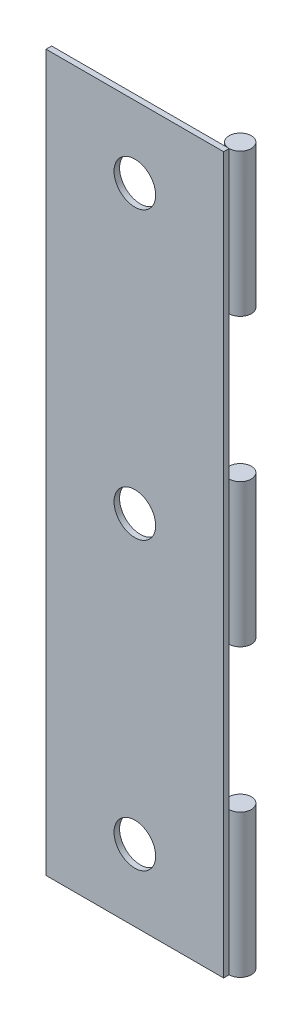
ISO-10303-21;
HEADER;
FILE_DESCRIPTION(('STEP AP214'),'2;1');
FILE_NAME('part.step','',(''),(''),'','','');
FILE_SCHEMA(('AUTOMOTIVE_DESIGN { 1 0 10303 214 1 1 1 1 }'));
ENDSEC;
DATA;
#1=APPLICATION_CONTEXT('core data for automotive mechanical design processes');
#2=APPLICATION_PROTOCOL_DEFINITION('international standard','automotive_design',2000,#1);
#3=PRODUCT_CONTEXT('',#1,'mechanical');
#4=PRODUCT('Part','Part','',(#3));
#5=PRODUCT_RELATED_PRODUCT_CATEGORY('part','',(#4));
#6=PRODUCT_DEFINITION_FORMATION('','',#4);
#7=PRODUCT_DEFINITION_CONTEXT('part definition',#1,'design');
#8=PRODUCT_DEFINITION('design','',#6,#7);
#9=PRODUCT_DEFINITION_SHAPE('','',#8);
#10=(LENGTH_UNIT() NAMED_UNIT(*) SI_UNIT(.MILLI.,.METRE.));
#11=(NAMED_UNIT(*) PLANE_ANGLE_UNIT() SI_UNIT($,.RADIAN.));
#12=(NAMED_UNIT(*) SI_UNIT($,.STERADIAN.) SOLID_ANGLE_UNIT());
#13=UNCERTAINTY_MEASURE_WITH_UNIT(LENGTH_MEASURE(1.E-05),#10,'distance_accuracy_value','');
#14=(GEOMETRIC_REPRESENTATION_CONTEXT(3) GLOBAL_UNCERTAINTY_ASSIGNED_CONTEXT((#13)) GLOBAL_UNIT_ASSIGNED_CONTEXT((#10,
#11,#12)) REPRESENTATION_CONTEXT('',''));
#15=CARTESIAN_POINT('',(0.,0.,0.));
#16=DIRECTION('',(0.,0.,1.));
#17=DIRECTION('',(1.,0.,0.));
#18=AXIS2_PLACEMENT_3D('',#15,#16,#17);
#19=CARTESIAN_POINT('',(0.,64.5,0.));
#20=DIRECTION('',(0.,1.,0.));
#21=DIRECTION('',(0.,0.,1.));
#22=AXIS2_PLACEMENT_3D('',#19,#20,#21);
#23=PLANE('',#22);
#24=DIRECTION('',(0.,0.,1.));
#25=VECTOR('',#24,1.);
#26=CARTESIAN_POINT('',(0.,64.5,1.));
#27=LINE('',#26,#25);
#28=CARTESIAN_POINT('',(0.,64.5,1.));
#29=VERTEX_POINT('',#28);
#30=CARTESIAN_POINT('',(0.,64.5,1.5));
#31=VERTEX_POINT('',#30);
#32=EDGE_CURVE('E50',#29,#31,#27,.T.);
#33=ORIENTED_EDGE('',*,*,#32,.F.);
#34=DIRECTION('',(1.,0.,0.));
#35=VECTOR('',#34,1.);
#36=CARTESIAN_POINT('',(0.,64.5,1.));
#37=LINE('',#36,#35);
#38=CARTESIAN_POINT('',(-16.,64.5,1.));
#39=VERTEX_POINT('',#38);
#40=EDGE_CURVE('E73',#39,#29,#37,.T.);
#41=ORIENTED_EDGE('',*,*,#40,.F.);
#42=DIRECTION('',(0.,0.,-1.));
#43=VECTOR('',#42,1.);
#44=CARTESIAN_POINT('',(-16.,64.5,1.));
#45=LINE('',#44,#43);
#46=CARTESIAN_POINT('',(-16.,64.5,1.5));
#47=VERTEX_POINT('',#46);
#48=EDGE_CURVE('E78',#47,#39,#45,.T.);
#49=ORIENTED_EDGE('',*,*,#48,.F.);
#50=DIRECTION('',(-1.,0.,0.));
#51=VECTOR('',#50,1.);
#52=CARTESIAN_POINT('',(0.,64.5,1.5));
#53=LINE('',#52,#51);
#54=EDGE_CURVE('E93',#31,#47,#53,.T.);
#55=ORIENTED_EDGE('',*,*,#54,.F.);
#56=EDGE_LOOP('',(#33,#41,#49,#55));
#57=FACE_BOUND('',#56,.T.);
#58=ADVANCED_FACE('F42',(#57),#23,.T.);
#59=CARTESIAN_POINT('',(0.,0.,0.));
#60=DIRECTION('',(0.,-1.,0.));
#61=DIRECTION('',(0.,0.,-1.));
#62=AXIS2_PLACEMENT_3D('',#59,#60,#61);
#63=PLANE('',#62);
#64=DIRECTION('',(0.,0.,1.));
#65=VECTOR('',#64,1.);
#66=CARTESIAN_POINT('',(0.,0.,1.));
#67=LINE('',#66,#65);
#68=CARTESIAN_POINT('',(0.,0.,1.));
#69=VERTEX_POINT('',#68);
#70=CARTESIAN_POINT('',(0.,0.,1.5));
#71=VERTEX_POINT('',#70);
#72=EDGE_CURVE('E102',#69,#71,#67,.T.);
#73=ORIENTED_EDGE('',*,*,#72,.T.);
#74=DIRECTION('',(-1.,0.,0.));
#75=VECTOR('',#74,1.);
#76=CARTESIAN_POINT('',(0.,0.,1.5));
#77=LINE('',#76,#75);
#78=CARTESIAN_POINT('',(-16.,0.,1.5));
#79=VERTEX_POINT('',#78);
#80=EDGE_CURVE('E91',#71,#79,#77,.T.);
#81=ORIENTED_EDGE('',*,*,#80,.T.);
#82=DIRECTION('',(0.,0.,-1.));
#83=VECTOR('',#82,1.);
#84=CARTESIAN_POINT('',(-16.,0.,1.));
#85=LINE('',#84,#83);
#86=CARTESIAN_POINT('',(-16.,0.,1.));
#87=VERTEX_POINT('',#86);
#88=EDGE_CURVE('E94',#79,#87,#85,.T.);
#89=ORIENTED_EDGE('',*,*,#88,.T.);
#90=DIRECTION('',(1.,0.,0.));
#91=VECTOR('',#90,1.);
#92=CARTESIAN_POINT('',(0.,0.,1.));
#93=LINE('',#92,#91);
#94=EDGE_CURVE('E99',#87,#69,#93,.T.);
#95=ORIENTED_EDGE('',*,*,#94,.T.);
#96=EDGE_LOOP('',(#73,#81,#89,#95));
#97=FACE_BOUND('',#96,.T.);
#98=ADVANCED_FACE('F101',(#97),#63,.T.);
#99=CARTESIAN_POINT('',(0.,80.5078105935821,1.5));
#100=DIRECTION('',(0.,0.,1.));
#101=DIRECTION('',(1.,0.,0.));
#102=AXIS2_PLACEMENT_3D('',#99,#100,#101);
#103=PLANE('',#102);
#104=CARTESIAN_POINT('',(-8.,58.0476526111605,1.5));
#105=DIRECTION('',(0.,0.,1.));
#106=DIRECTION('',(1.,0.,0.));
#107=AXIS2_PLACEMENT_3D('',#104,#105,#106);
#108=CIRCLE('',#107,1.875);
#109=CARTESIAN_POINT('',(-6.125,58.0476526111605,1.5));
#110=VERTEX_POINT('',#109);
#111=EDGE_CURVE('E125',#110,#110,#108,.F.);
#112=ORIENTED_EDGE('',*,*,#111,.T.);
#113=EDGE_LOOP('',(#112));
#114=FACE_BOUND('',#113,.T.);
#115=CARTESIAN_POINT('',(-8.,6.45,1.5));
#116=DIRECTION('',(0.,0.,1.));
#117=DIRECTION('',(1.,0.,0.));
#118=AXIS2_PLACEMENT_3D('',#115,#116,#117);
#119=CIRCLE('',#118,1.875);
#120=CARTESIAN_POINT('',(-6.125,6.45,1.5));
#121=VERTEX_POINT('',#120);
#122=EDGE_CURVE('E131',#121,#121,#119,.F.);
#123=ORIENTED_EDGE('',*,*,#122,.T.);
#124=EDGE_LOOP('',(#123));
#125=FACE_BOUND('',#124,.T.);
#126=CARTESIAN_POINT('',(-8.,32.25,1.5));
#127=DIRECTION('',(0.,0.,1.));
#128=DIRECTION('',(1.,0.,0.));
#129=AXIS2_PLACEMENT_3D('',#126,#127,#128);
#130=CIRCLE('',#129,1.875);
#131=CARTESIAN_POINT('',(-6.125,32.25,1.5));
#132=VERTEX_POINT('',#131);
#133=EDGE_CURVE('E119',#132,#132,#130,.F.);
#134=ORIENTED_EDGE('',*,*,#133,.T.);
#135=EDGE_LOOP('',(#134));
#136=FACE_BOUND('',#135,.T.);
#137=DIRECTION('',(0.,-1.,0.));
#138=VECTOR('',#137,1.);
#139=CARTESIAN_POINT('',(0.,80.5078105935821,1.5));
#140=LINE('',#139,#138);
#141=EDGE_CURVE('E12',#31,#71,#140,.T.);
#142=ORIENTED_EDGE('',*,*,#141,.F.);
#143=ORIENTED_EDGE('',*,*,#54,.T.);
#144=DIRECTION('',(0.,-1.,0.));
#145=VECTOR('',#144,1.);
#146=CARTESIAN_POINT('',(-16.,80.5078105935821,1.5));
#147=LINE('',#146,#145);
#148=EDGE_CURVE('E88',#47,#79,#147,.T.);
#149=ORIENTED_EDGE('',*,*,#148,.T.);
#150=ORIENTED_EDGE('',*,*,#80,.F.);
#151=EDGE_LOOP('',(#142,#143,#149,#150));
#152=FACE_BOUND('',#151,.T.);
#153=ADVANCED_FACE('F89',(#114,#125,#136,#152),#103,.T.);
#154=CARTESIAN_POINT('',(-16.,80.5078105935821,1.));
#155=DIRECTION('',(-1.,0.,0.));
#156=DIRECTION('',(0.,0.,1.));
#157=AXIS2_PLACEMENT_3D('',#154,#155,#156);
#158=PLANE('',#157);
#159=ORIENTED_EDGE('',*,*,#148,.F.);
#160=ORIENTED_EDGE('',*,*,#48,.T.);
#161=DIRECTION('',(0.,-1.,0.));
#162=VECTOR('',#161,1.);
#163=CARTESIAN_POINT('',(-16.,80.5078105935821,1.));
#164=LINE('',#163,#162);
#165=EDGE_CURVE('E83',#39,#87,#164,.T.);
#166=ORIENTED_EDGE('',*,*,#165,.T.);
#167=ORIENTED_EDGE('',*,*,#88,.F.);
#168=EDGE_LOOP('',(#159,#160,#166,#167));
#169=FACE_BOUND('',#168,.T.);
#170=ADVANCED_FACE('F95',(#169),#158,.T.);
#171=CARTESIAN_POINT('',(0.,80.5078105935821,1.));
#172=DIRECTION('',(0.,0.,-1.));
#173=DIRECTION('',(-1.,0.,0.));
#174=AXIS2_PLACEMENT_3D('',#171,#172,#173);
#175=PLANE('',#174);
#176=CARTESIAN_POINT('',(-8.,58.0476526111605,1.));
#177=DIRECTION('',(0.,0.,-1.));
#178=DIRECTION('',(-1.,0.,0.));
#179=AXIS2_PLACEMENT_3D('',#176,#177,#178);
#180=CIRCLE('',#179,1.875);
#181=CARTESIAN_POINT('',(-9.875,58.0476526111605,1.));
#182=VERTEX_POINT('',#181);
#183=EDGE_CURVE('E128',#182,#182,#180,.T.);
#184=ORIENTED_EDGE('',*,*,#183,.F.);
#185=EDGE_LOOP('',(#184));
#186=FACE_BOUND('',#185,.T.);
#187=CARTESIAN_POINT('',(-8.,6.45,1.));
#188=DIRECTION('',(0.,0.,-1.));
#189=DIRECTION('',(-1.,0.,0.));
#190=AXIS2_PLACEMENT_3D('',#187,#188,#189);
#191=CIRCLE('',#190,1.875);
#192=CARTESIAN_POINT('',(-9.875,6.45,1.));
#193=VERTEX_POINT('',#192);
#194=EDGE_CURVE('E122',#193,#193,#191,.T.);
#195=ORIENTED_EDGE('',*,*,#194,.F.);
#196=EDGE_LOOP('',(#195));
#197=FACE_BOUND('',#196,.T.);
#198=CARTESIAN_POINT('',(-8.,32.25,1.));
#199=DIRECTION('',(0.,0.,-1.));
#200=DIRECTION('',(-1.,0.,0.));
#201=AXIS2_PLACEMENT_3D('',#198,#199,#200);
#202=CIRCLE('',#201,1.875);
#203=CARTESIAN_POINT('',(-9.875,32.25,1.));
#204=VERTEX_POINT('',#203);
#205=EDGE_CURVE('E104',#204,#204,#202,.T.);
#206=ORIENTED_EDGE('',*,*,#205,.F.);
#207=EDGE_LOOP('',(#206));
#208=FACE_BOUND('',#207,.T.);
#209=ORIENTED_EDGE('',*,*,#165,.F.);
#210=ORIENTED_EDGE('',*,*,#40,.T.);
#211=DIRECTION('',(0.,-1.,0.));
#212=VECTOR('',#211,1.);
#213=CARTESIAN_POINT('',(0.,80.5078105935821,1.));
#214=LINE('',#213,#212);
#215=EDGE_CURVE('E110',#29,#69,#214,.T.);
#216=ORIENTED_EDGE('',*,*,#215,.T.);
#217=ORIENTED_EDGE('',*,*,#94,.F.);
#218=EDGE_LOOP('',(#209,#210,#216,#217));
#219=FACE_BOUND('',#218,.T.);
#220=ADVANCED_FACE('F116',(#186,#197,#208,#219),#175,.T.);
#221=CARTESIAN_POINT('',(0.,80.5078105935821,1.));
#222=DIRECTION('',(1.,0.,0.));
#223=DIRECTION('',(0.,0.,-1.));
#224=AXIS2_PLACEMENT_3D('',#221,#222,#223);
#225=PLANE('',#224);
#226=ORIENTED_EDGE('',*,*,#215,.F.);
#227=ORIENTED_EDGE('',*,*,#32,.T.);
#228=ORIENTED_EDGE('',*,*,#141,.T.);
#229=ORIENTED_EDGE('',*,*,#72,.F.);
#230=EDGE_LOOP('',(#226,#227,#228,#229));
#231=FACE_BOUND('',#230,.T.);
#232=ADVANCED_FACE('F117',(#231),#225,.T.);
#233=CARTESIAN_POINT('',(-8.,32.25,1.501));
#234=DIRECTION('',(0.,0.,-1.));
#235=DIRECTION('',(-1.,0.,0.));
#236=AXIS2_PLACEMENT_3D('',#233,#234,#235);
#237=CYLINDRICAL_SURFACE('',#236,1.875);
#238=ORIENTED_EDGE('',*,*,#133,.F.);
#239=EDGE_LOOP('',(#238));
#240=FACE_BOUND('',#239,.T.);
#241=ORIENTED_EDGE('',*,*,#205,.T.);
#242=EDGE_LOOP('',(#241));
#243=FACE_BOUND('',#242,.T.);
#244=ADVANCED_FACE('F145',(#240,#243),#237,.F.);
#245=CARTESIAN_POINT('',(-8.,6.45,1.501));
#246=DIRECTION('',(0.,0.,-1.));
#247=DIRECTION('',(-1.,0.,0.));
#248=AXIS2_PLACEMENT_3D('',#245,#246,#247);
#249=CYLINDRICAL_SURFACE('',#248,1.875);
#250=ORIENTED_EDGE('',*,*,#122,.F.);
#251=EDGE_LOOP('',(#250));
#252=FACE_BOUND('',#251,.T.);
#253=ORIENTED_EDGE('',*,*,#194,.T.);
#254=EDGE_LOOP('',(#253));
#255=FACE_BOUND('',#254,.T.);
#256=ADVANCED_FACE('F137',(#252,#255),#249,.F.);
#257=CARTESIAN_POINT('',(-8.,58.0476526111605,1.501));
#258=DIRECTION('',(0.,0.,-1.));
#259=DIRECTION('',(-1.,0.,0.));
#260=AXIS2_PLACEMENT_3D('',#257,#258,#259);
#261=CYLINDRICAL_SURFACE('',#260,1.875);
#262=ORIENTED_EDGE('',*,*,#111,.F.);
#263=EDGE_LOOP('',(#262));
#264=FACE_BOUND('',#263,.T.);
#265=ORIENTED_EDGE('',*,*,#183,.T.);
#266=EDGE_LOOP('',(#265));
#267=FACE_BOUND('',#266,.T.);
#268=ADVANCED_FACE('F153',(#264,#267),#261,.F.);
#269=CLOSED_SHELL('',(#58,#98,#153,#170,#220,#232,#244,#256,#268));
#270=MANIFOLD_SOLID_BREP('B2',#269);
#271=CARTESIAN_POINT('',(-3.00461610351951,12.9,1.001));
#272=DIRECTION('',(0.,1.,0.));
#273=DIRECTION('',(0.,0.,1.));
#274=AXIS2_PLACEMENT_3D('',#271,#272,#273);
#275=PLANE('',#274);
#276=CARTESIAN_POINT('',(0.,12.9,0.));
#277=DIRECTION('',(0.,1.,0.));
#278=DIRECTION('',(0.,0.,1.));
#279=AXIS2_PLACEMENT_3D('',#276,#277,#278);
#280=CIRCLE('',#279,1.);
#281=CARTESIAN_POINT('',(0.,12.9,1.));
#282=VERTEX_POINT('',#281);
#283=EDGE_CURVE('E41',#282,#282,#280,.F.);
#284=ORIENTED_EDGE('',*,*,#283,.F.);
#285=EDGE_LOOP('',(#284));
#286=FACE_BOUND('',#285,.T.);
#287=ADVANCED_FACE('F237',(#286),#275,.T.);
#288=CARTESIAN_POINT('',(0.,0.,0.));
#289=DIRECTION('',(0.,1.,0.));
#290=DIRECTION('',(0.,0.,1.));
#291=AXIS2_PLACEMENT_3D('',#288,#289,#290);
#292=PLANE('',#291);
#293=CARTESIAN_POINT('',(0.,0.,0.));
#294=DIRECTION('',(0.,1.,0.));
#295=DIRECTION('',(0.,0.,1.));
#296=AXIS2_PLACEMENT_3D('',#293,#294,#295);
#297=CIRCLE('',#296,1.);
#298=CARTESIAN_POINT('',(0.,0.,1.));
#299=VERTEX_POINT('',#298);
#300=EDGE_CURVE('E244',#299,#299,#297,.T.);
#301=ORIENTED_EDGE('',*,*,#300,.F.);
#302=EDGE_LOOP('',(#301));
#303=FACE_BOUND('',#302,.T.);
#304=ADVANCED_FACE('F251',(#303),#292,.F.);
#305=CARTESIAN_POINT('',(0.,64.5,0.));
#306=DIRECTION('',(0.,-1.,0.));
#307=DIRECTION('',(0.,0.,-1.));
#308=AXIS2_PLACEMENT_3D('',#305,#306,#307);
#309=CYLINDRICAL_SURFACE('',#308,1.);
#310=ORIENTED_EDGE('',*,*,#300,.T.);
#311=EDGE_LOOP('',(#310));
#312=FACE_BOUND('',#311,.T.);
#313=ORIENTED_EDGE('',*,*,#283,.T.);
#314=EDGE_LOOP('',(#313));
#315=FACE_BOUND('',#314,.T.);
#316=ADVANCED_FACE('F239',(#312,#315),#309,.T.);
#317=CLOSED_SHELL('',(#287,#304,#316));
#318=MANIFOLD_SOLID_BREP('B6',#317);
#319=CARTESIAN_POINT('',(-3.00461610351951,38.7,1.001));
#320=DIRECTION('',(0.,1.,0.));
#321=DIRECTION('',(0.,0.,1.));
#322=AXIS2_PLACEMENT_3D('',#319,#320,#321);
#323=PLANE('',#322);
#324=CARTESIAN_POINT('',(0.,38.7,0.));
#325=DIRECTION('',(0.,1.,0.));
#326=DIRECTION('',(0.,0.,1.));
#327=AXIS2_PLACEMENT_3D('',#324,#325,#326);
#328=CIRCLE('',#327,1.);
#329=CARTESIAN_POINT('',(0.,38.7,1.));
#330=VERTEX_POINT('',#329);
#331=EDGE_CURVE('E236',#330,#330,#328,.F.);
#332=ORIENTED_EDGE('',*,*,#331,.F.);
#333=EDGE_LOOP('',(#332));
#334=FACE_BOUND('',#333,.T.);
#335=ADVANCED_FACE('F279',(#334),#323,.T.);
#336=CARTESIAN_POINT('',(0.,64.5,0.));
#337=DIRECTION('',(0.,-1.,0.));
#338=DIRECTION('',(0.,0.,-1.));
#339=AXIS2_PLACEMENT_3D('',#336,#337,#338);
#340=CYLINDRICAL_SURFACE('',#339,1.);
#341=CARTESIAN_POINT('',(0.,25.8,0.));
#342=DIRECTION('',(0.,-1.,0.));
#343=DIRECTION('',(0.,0.,-1.));
#344=AXIS2_PLACEMENT_3D('',#341,#342,#343);
#345=CIRCLE('',#344,1.);
#346=CARTESIAN_POINT('',(0.,25.8,-1.));
#347=VERTEX_POINT('',#346);
#348=EDGE_CURVE('E286',#347,#347,#345,.F.);
#349=ORIENTED_EDGE('',*,*,#348,.T.);
#350=EDGE_LOOP('',(#349));
#351=FACE_BOUND('',#350,.T.);
#352=ORIENTED_EDGE('',*,*,#331,.T.);
#353=EDGE_LOOP('',(#352));
#354=FACE_BOUND('',#353,.T.);
#355=ADVANCED_FACE('F281',(#351,#354),#340,.T.);
#356=CARTESIAN_POINT('',(-3.00461610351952,25.8,1.001));
#357=DIRECTION('',(0.,-1.,0.));
#358=DIRECTION('',(0.,0.,-1.));
#359=AXIS2_PLACEMENT_3D('',#356,#357,#358);
#360=PLANE('',#359);
#361=ORIENTED_EDGE('',*,*,#348,.F.);
#362=EDGE_LOOP('',(#361));
#363=FACE_BOUND('',#362,.T.);
#364=ADVANCED_FACE('F293',(#363),#360,.T.);
#365=CLOSED_SHELL('',(#335,#355,#364));
#366=MANIFOLD_SOLID_BREP('B36',#365);
#367=CARTESIAN_POINT('',(0.,64.5,0.));
#368=DIRECTION('',(0.,-1.,0.));
#369=DIRECTION('',(0.,0.,-1.));
#370=AXIS2_PLACEMENT_3D('',#367,#368,#369);
#371=CYLINDRICAL_SURFACE('',#370,1.);
#372=CARTESIAN_POINT('',(0.,51.6,0.));
#373=DIRECTION('',(0.,-1.,0.));
#374=DIRECTION('',(0.,0.,-1.));
#375=AXIS2_PLACEMENT_3D('',#372,#373,#374);
#376=CIRCLE('',#375,1.);
#377=CARTESIAN_POINT('',(0.,51.6,-1.));
#378=VERTEX_POINT('',#377);
#379=EDGE_CURVE('E320',#378,#378,#376,.F.);
#380=ORIENTED_EDGE('',*,*,#379,.T.);
#381=EDGE_LOOP('',(#380));
#382=FACE_BOUND('',#381,.T.);
#383=CARTESIAN_POINT('',(0.,64.5,0.));
#384=DIRECTION('',(0.,1.,0.));
#385=DIRECTION('',(0.,0.,1.));
#386=AXIS2_PLACEMENT_3D('',#383,#384,#385);
#387=CIRCLE('',#386,1.);
#388=CARTESIAN_POINT('',(0.,64.5,1.));
#389=VERTEX_POINT('',#388);
#390=EDGE_CURVE('E278',#389,#389,#387,.T.);
#391=ORIENTED_EDGE('',*,*,#390,.F.);
#392=EDGE_LOOP('',(#391));
#393=FACE_BOUND('',#392,.T.);
#394=ADVANCED_FACE('F314',(#382,#393),#371,.T.);
#395=CARTESIAN_POINT('',(0.,64.5,0.));
#396=DIRECTION('',(0.,1.,0.));
#397=DIRECTION('',(0.,0.,1.));
#398=AXIS2_PLACEMENT_3D('',#395,#396,#397);
#399=PLANE('',#398);
#400=ORIENTED_EDGE('',*,*,#390,.T.);
#401=EDGE_LOOP('',(#400));
#402=FACE_BOUND('',#401,.T.);
#403=ADVANCED_FACE('F330',(#402),#399,.T.);
#404=CARTESIAN_POINT('',(-3.00461610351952,51.6,1.001));
#405=DIRECTION('',(0.,-1.,0.));
#406=DIRECTION('',(0.,0.,-1.));
#407=AXIS2_PLACEMENT_3D('',#404,#405,#406);
#408=PLANE('',#407);
#409=ORIENTED_EDGE('',*,*,#379,.F.);
#410=EDGE_LOOP('',(#409));
#411=FACE_BOUND('',#410,.T.);
#412=ADVANCED_FACE('F328',(#411),#408,.T.);
#413=CLOSED_SHELL('',(#394,#403,#412));
#414=MANIFOLD_SOLID_BREP('B231',#413);
#415=ADVANCED_BREP_SHAPE_REPRESENTATION('',(#18,#270,#318,#366,#414),#14);
#416=SHAPE_DEFINITION_REPRESENTATION(#9,#415);
ENDSEC;
END-ISO-10303-21;
